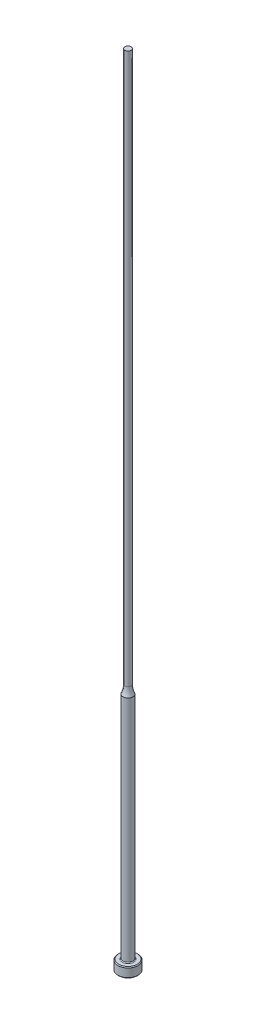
ISO-10303-21;
HEADER;
FILE_DESCRIPTION(('STEP AP214'),'2;1');
FILE_NAME('part.step','',(''),(''),'','','');
FILE_SCHEMA(('AUTOMOTIVE_DESIGN { 1 0 10303 214 1 1 1 1 }'));
ENDSEC;
DATA;
#1=APPLICATION_CONTEXT('core data for automotive mechanical design processes');
#2=APPLICATION_PROTOCOL_DEFINITION('international standard','automotive_design',2000,#1);
#3=PRODUCT_CONTEXT('',#1,'mechanical');
#4=PRODUCT('Part','Part','',(#3));
#5=PRODUCT_RELATED_PRODUCT_CATEGORY('part','',(#4));
#6=PRODUCT_DEFINITION_FORMATION('','',#4);
#7=PRODUCT_DEFINITION_CONTEXT('part definition',#1,'design');
#8=PRODUCT_DEFINITION('design','',#6,#7);
#9=PRODUCT_DEFINITION_SHAPE('','',#8);
#10=(LENGTH_UNIT() NAMED_UNIT(*) SI_UNIT(.MILLI.,.METRE.));
#11=(NAMED_UNIT(*) PLANE_ANGLE_UNIT() SI_UNIT($,.RADIAN.));
#12=(NAMED_UNIT(*) SI_UNIT($,.STERADIAN.) SOLID_ANGLE_UNIT());
#13=UNCERTAINTY_MEASURE_WITH_UNIT(LENGTH_MEASURE(1.E-05),#10,'distance_accuracy_value','');
#14=(GEOMETRIC_REPRESENTATION_CONTEXT(3) GLOBAL_UNCERTAINTY_ASSIGNED_CONTEXT((#13)) GLOBAL_UNIT_ASSIGNED_CONTEXT((#10,
#11,#12)) REPRESENTATION_CONTEXT('',''));
#15=CARTESIAN_POINT('',(0.,0.,0.));
#16=DIRECTION('',(0.,0.,1.));
#17=DIRECTION('',(1.,0.,0.));
#18=AXIS2_PLACEMENT_3D('',#15,#16,#17);
#19=CARTESIAN_POINT('',(-0.991869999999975,254.,0.));
#20=DIRECTION('',(0.,1.,0.));
#21=DIRECTION('',(0.,0.,1.));
#22=AXIS2_PLACEMENT_3D('',#19,#20,#21);
#23=PLANE('',#22);
#24=CARTESIAN_POINT('',(0.,254.,0.));
#25=DIRECTION('',(0.,1.,0.));
#26=DIRECTION('',(0.,0.,1.));
#27=AXIS2_PLACEMENT_3D('',#24,#25,#26);
#28=CIRCLE('',#27,0.991869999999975);
#29=CARTESIAN_POINT('',(0.,254.,0.991869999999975));
#30=VERTEX_POINT('',#29);
#31=EDGE_CURVE('E56',#30,#30,#28,.T.);
#32=ORIENTED_EDGE('',*,*,#31,.T.);
#33=EDGE_LOOP('',(#32));
#34=FACE_BOUND('',#33,.T.);
#35=ADVANCED_FACE('F30',(#34),#23,.T.);
#36=CARTESIAN_POINT('',(0.,259.958771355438,0.));
#37=DIRECTION('',(0.,1.,0.));
#38=DIRECTION('',(0.,0.,1.));
#39=AXIS2_PLACEMENT_3D('',#36,#37,#38);
#40=CYLINDRICAL_SURFACE('',#39,0.991869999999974);
#41=CARTESIAN_POINT('',(0.,78.8850932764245,0.));
#42=DIRECTION('',(0.,1.,0.));
#43=DIRECTION('',(0.,0.,1.));
#44=AXIS2_PLACEMENT_3D('',#41,#42,#43);
#45=CIRCLE('',#44,0.991869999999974);
#46=CARTESIAN_POINT('',(0.,78.8850932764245,0.991869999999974));
#47=VERTEX_POINT('',#46);
#48=EDGE_CURVE('E59',#47,#47,#45,.T.);
#49=ORIENTED_EDGE('',*,*,#48,.T.);
#50=EDGE_LOOP('',(#49));
#51=FACE_BOUND('',#50,.T.);
#52=ORIENTED_EDGE('',*,*,#31,.F.);
#53=EDGE_LOOP('',(#52));
#54=FACE_BOUND('',#53,.T.);
#55=ADVANCED_FACE('F79',(#51,#54),#40,.T.);
#56=CARTESIAN_POINT('',(0.,78.8850932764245,0.));
#57=DIRECTION('',(0.,1.,0.));
#58=DIRECTION('',(0.,0.,1.));
#59=AXIS2_PLACEMENT_3D('',#56,#57,#58);
#60=TOROIDAL_SURFACE('',#59,7.34186999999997,6.35);
#61=CARTESIAN_POINT('',(0.,76.2,0.));
#62=DIRECTION('',(0.,1.,0.));
#63=DIRECTION('',(0.,0.,1.));
#64=AXIS2_PLACEMENT_3D('',#61,#62,#63);
#65=CIRCLE('',#64,1.58749999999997);
#66=CARTESIAN_POINT('',(0.,76.2,1.58749999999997));
#67=VERTEX_POINT('',#66);
#68=EDGE_CURVE('E62',#67,#67,#65,.T.);
#69=ORIENTED_EDGE('',*,*,#68,.T.);
#70=EDGE_LOOP('',(#69));
#71=FACE_BOUND('',#70,.T.);
#72=ORIENTED_EDGE('',*,*,#48,.F.);
#73=EDGE_LOOP('',(#72));
#74=FACE_BOUND('',#73,.T.);
#75=ADVANCED_FACE('F66',(#71,#74),#60,.F.);
#76=CARTESIAN_POINT('',(0.,259.958771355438,0.));
#77=DIRECTION('',(0.,1.,0.));
#78=DIRECTION('',(0.,0.,1.));
#79=AXIS2_PLACEMENT_3D('',#76,#77,#78);
#80=CYLINDRICAL_SURFACE('',#79,1.58749999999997);
#81=CARTESIAN_POINT('',(0.,3.42900000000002,0.));
#82=DIRECTION('',(0.,1.,0.));
#83=DIRECTION('',(0.,0.,1.));
#84=AXIS2_PLACEMENT_3D('',#81,#82,#83);
#85=CIRCLE('',#84,1.58749999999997);
#86=CARTESIAN_POINT('',(0.,3.42900000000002,1.58749999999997));
#87=VERTEX_POINT('',#86);
#88=EDGE_CURVE('E37',#87,#87,#85,.T.);
#89=ORIENTED_EDGE('',*,*,#88,.T.);
#90=EDGE_LOOP('',(#89));
#91=FACE_BOUND('',#90,.T.);
#92=ORIENTED_EDGE('',*,*,#68,.F.);
#93=EDGE_LOOP('',(#92));
#94=FACE_BOUND('',#93,.T.);
#95=ADVANCED_FACE('F69',(#91,#94),#80,.T.);
#96=CARTESIAN_POINT('',(-3.17499999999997,3.175,0.));
#97=DIRECTION('',(0.,1.,0.));
#98=DIRECTION('',(0.,0.,1.));
#99=AXIS2_PLACEMENT_3D('',#96,#97,#98);
#100=PLANE('',#99);
#101=CARTESIAN_POINT('',(0.,3.175,0.));
#102=DIRECTION('',(0.,1.,0.));
#103=DIRECTION('',(0.,0.,1.));
#104=AXIS2_PLACEMENT_3D('',#101,#102,#103);
#105=CIRCLE('',#104,1.84149999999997);
#106=CARTESIAN_POINT('',(0.,3.175,1.84149999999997));
#107=VERTEX_POINT('',#106);
#108=EDGE_CURVE('E10',#107,#107,#105,.F.);
#109=ORIENTED_EDGE('',*,*,#108,.T.);
#110=EDGE_LOOP('',(#109));
#111=FACE_BOUND('',#110,.T.);
#112=CARTESIAN_POINT('',(0.,3.175,0.));
#113=DIRECTION('',(0.,1.,0.));
#114=DIRECTION('',(0.,0.,1.));
#115=AXIS2_PLACEMENT_3D('',#112,#113,#114);
#116=CIRCLE('',#115,2.92099999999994);
#117=CARTESIAN_POINT('',(0.,3.175,2.92099999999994));
#118=VERTEX_POINT('',#117);
#119=EDGE_CURVE('E53',#118,#118,#116,.T.);
#120=ORIENTED_EDGE('',*,*,#119,.T.);
#121=EDGE_LOOP('',(#120));
#122=FACE_BOUND('',#121,.T.);
#123=ADVANCED_FACE('F71',(#111,#122),#100,.T.);
#124=CARTESIAN_POINT('',(0.,259.958771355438,0.));
#125=DIRECTION('',(0.,1.,0.));
#126=DIRECTION('',(0.,0.,1.));
#127=AXIS2_PLACEMENT_3D('',#124,#125,#126);
#128=CYLINDRICAL_SURFACE('',#127,3.17499999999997);
#129=CARTESIAN_POINT('',(0.,2.92100000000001,0.));
#130=DIRECTION('',(0.,1.,0.));
#131=DIRECTION('',(0.,0.,1.));
#132=AXIS2_PLACEMENT_3D('',#129,#130,#131);
#133=CIRCLE('',#132,3.17499999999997);
#134=CARTESIAN_POINT('',(0.,2.92100000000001,3.17499999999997));
#135=VERTEX_POINT('',#134);
#136=EDGE_CURVE('E45',#135,#135,#133,.F.);
#137=ORIENTED_EDGE('',*,*,#136,.T.);
#138=EDGE_LOOP('',(#137));
#139=FACE_BOUND('',#138,.T.);
#140=CARTESIAN_POINT('',(0.,0.253999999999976,0.));
#141=DIRECTION('',(0.,-1.,0.));
#142=DIRECTION('',(0.,0.,-1.));
#143=AXIS2_PLACEMENT_3D('',#140,#141,#142);
#144=CIRCLE('',#143,3.17499999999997);
#145=CARTESIAN_POINT('',(0.,0.253999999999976,-3.17499999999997));
#146=VERTEX_POINT('',#145);
#147=EDGE_CURVE('E50',#146,#146,#144,.F.);
#148=ORIENTED_EDGE('',*,*,#147,.T.);
#149=EDGE_LOOP('',(#148));
#150=FACE_BOUND('',#149,.T.);
#151=ADVANCED_FACE('F77',(#139,#150),#128,.T.);
#152=CARTESIAN_POINT('',(0.,0.,0.));
#153=DIRECTION('',(0.,-1.,0.));
#154=DIRECTION('',(0.,0.,-1.));
#155=AXIS2_PLACEMENT_3D('',#152,#153,#154);
#156=PLANE('',#155);
#157=CARTESIAN_POINT('',(0.,0.,0.));
#158=DIRECTION('',(0.,-1.,0.));
#159=DIRECTION('',(0.,0.,-1.));
#160=AXIS2_PLACEMENT_3D('',#157,#158,#159);
#161=CIRCLE('',#160,2.92100000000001);
#162=CARTESIAN_POINT('',(0.,0.,-2.92100000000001));
#163=VERTEX_POINT('',#162);
#164=EDGE_CURVE('E41',#163,#163,#161,.T.);
#165=ORIENTED_EDGE('',*,*,#164,.T.);
#166=EDGE_LOOP('',(#165));
#167=FACE_BOUND('',#166,.T.);
#168=ADVANCED_FACE('F93',(#167),#156,.T.);
#169=CARTESIAN_POINT('',(0.,3.17499999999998,0.));
#170=DIRECTION('',(0.,-1.,0.));
#171=DIRECTION('',(0.,0.,-1.));
#172=AXIS2_PLACEMENT_3D('',#169,#170,#171);
#173=CONICAL_SURFACE('',#172,2.92099999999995,0.785398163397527);
#174=ORIENTED_EDGE('',*,*,#136,.F.);
#175=EDGE_LOOP('',(#174));
#176=FACE_BOUND('',#175,.T.);
#177=ORIENTED_EDGE('',*,*,#119,.F.);
#178=EDGE_LOOP('',(#177));
#179=FACE_BOUND('',#178,.T.);
#180=ADVANCED_FACE('F90',(#176,#179),#173,.T.);
#181=CARTESIAN_POINT('',(0.,0.253999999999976,0.));
#182=DIRECTION('',(0.,1.,0.));
#183=DIRECTION('',(0.,0.,1.));
#184=AXIS2_PLACEMENT_3D('',#181,#182,#183);
#185=CONICAL_SURFACE('',#184,3.17499999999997,0.785398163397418);
#186=ORIENTED_EDGE('',*,*,#164,.F.);
#187=EDGE_LOOP('',(#186));
#188=FACE_BOUND('',#187,.T.);
#189=ORIENTED_EDGE('',*,*,#147,.F.);
#190=EDGE_LOOP('',(#189));
#191=FACE_BOUND('',#190,.T.);
#192=ADVANCED_FACE('F92',(#188,#191),#185,.T.);
#193=CARTESIAN_POINT('',(0.,3.42900000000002,0.));
#194=DIRECTION('',(0.,1.,0.));
#195=DIRECTION('',(0.,0.,1.));
#196=AXIS2_PLACEMENT_3D('',#193,#194,#195);
#197=TOROIDAL_SURFACE('',#196,1.84149999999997,0.254);
#198=ORIENTED_EDGE('',*,*,#108,.F.);
#199=EDGE_LOOP('',(#198));
#200=FACE_BOUND('',#199,.T.);
#201=ORIENTED_EDGE('',*,*,#88,.F.);
#202=EDGE_LOOP('',(#201));
#203=FACE_BOUND('',#202,.T.);
#204=ADVANCED_FACE('F32',(#200,#203),#197,.F.);
#205=CLOSED_SHELL('',(#35,#55,#75,#95,#123,#151,#168,#180,#192,#204));
#206=MANIFOLD_SOLID_BREP('B2',#205);
#207=ADVANCED_BREP_SHAPE_REPRESENTATION('',(#18,#206),#14);
#208=SHAPE_DEFINITION_REPRESENTATION(#9,#207);
ENDSEC;
END-ISO-10303-21;
